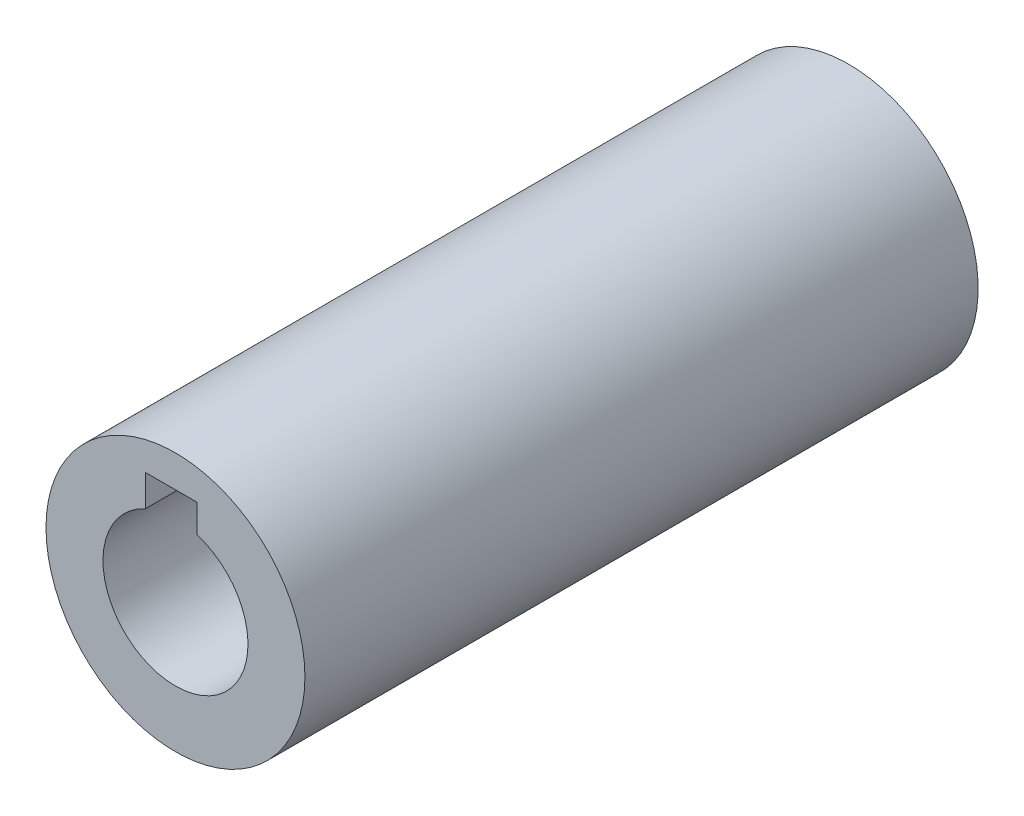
from build123d import *

# Parameters (mm, degrees)
SKETCH1_R           = 12.5
BOSS_EXTRUDE1_DEPTH = 30
BOSS_EXTRUDE2_START = 5
SKETCH4_R           = 12.5
BOSS_EXTRUDE2_DEPTH = 5
BOSS_EXTRUDE3_START = 30
SKETCH5_R           = 12.5
BOSS_EXTRUDE3_DEPTH = 30


with BuildPart() as part:
    # Sketch1 → Boss-Extrude1 (new body)
    with BuildSketch(Plane.XY):
        Circle(SKETCH1_R)
        with BuildLine():
            Line((-2.916666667, 6.3634154), (-2.916666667, 9.409059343))
            Line((-2.916666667, 9.409059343), (2.083333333, 9.409059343))
            Line((2.083333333, 9.409059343), (2.083333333, 6.682792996))
            ThreePointArc((2.083333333, 6.682792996), (0.446219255, -6.985763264), (-2.916666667, 6.3634154))
        make_face(mode=Mode.SUBTRACT)
    extrude(amount=BOSS_EXTRUDE1_DEPTH)

    # Sketch4 → Boss-Extrude2 (add)
    with BuildSketch(Plane(origin=(0, 0, 0), x_dir=(-1, 0, 0), z_dir=(0, 0, -1)).offset(BOSS_EXTRUDE2_START)):
        Circle(SKETCH4_R)
    extrude(amount=-BOSS_EXTRUDE2_DEPTH)

    # Sketch5 → Boss-Extrude3 (add)
    with BuildSketch(Plane(origin=(0, 0, -5), x_dir=(-1, 0, 0), z_dir=(0, 0, -1)).offset(BOSS_EXTRUDE3_START)):
        Circle(SKETCH5_R)
        with BuildLine():
            ThreePointArc((-1.25, 5.868347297), (0, -6), (1.25, 5.868347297))
            Line((1.25, 5.868347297), (1.25, 7.855680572))
            Line((1.25, 7.855680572), (-1.25, 7.855680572))
            Line((-1.25, 7.855680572), (-1.25, 5.868347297))
        make_face(mode=Mode.SUBTRACT)
    extrude(amount=-BOSS_EXTRUDE3_DEPTH)


solid = part.part
